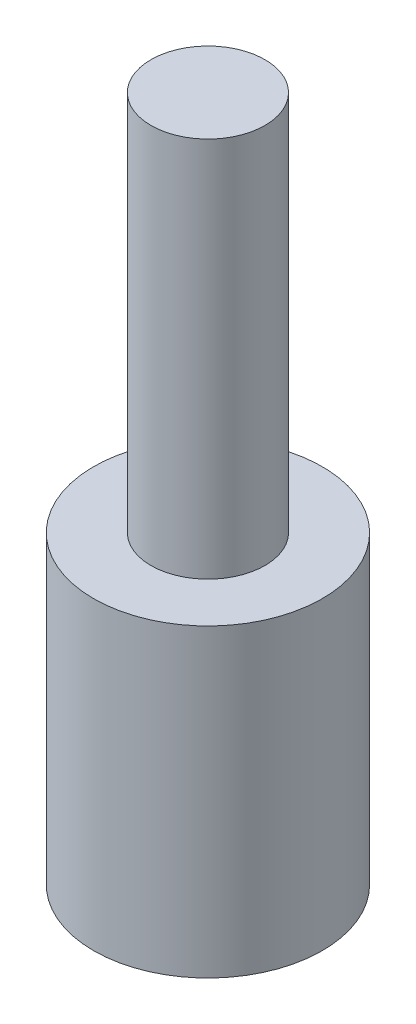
ISO-10303-21;
HEADER;
FILE_DESCRIPTION(('STEP AP214'),'2;1');
FILE_NAME('part.step','',(''),(''),'','','');
FILE_SCHEMA(('AUTOMOTIVE_DESIGN { 1 0 10303 214 1 1 1 1 }'));
ENDSEC;
DATA;
#1=APPLICATION_CONTEXT('core data for automotive mechanical design processes');
#2=APPLICATION_PROTOCOL_DEFINITION('international standard','automotive_design',2000,#1);
#3=PRODUCT_CONTEXT('',#1,'mechanical');
#4=PRODUCT('Part','Part','',(#3));
#5=PRODUCT_RELATED_PRODUCT_CATEGORY('part','',(#4));
#6=PRODUCT_DEFINITION_FORMATION('','',#4);
#7=PRODUCT_DEFINITION_CONTEXT('part definition',#1,'design');
#8=PRODUCT_DEFINITION('design','',#6,#7);
#9=PRODUCT_DEFINITION_SHAPE('','',#8);
#10=(LENGTH_UNIT() NAMED_UNIT(*) SI_UNIT(.MILLI.,.METRE.));
#11=(NAMED_UNIT(*) PLANE_ANGLE_UNIT() SI_UNIT($,.RADIAN.));
#12=(NAMED_UNIT(*) SI_UNIT($,.STERADIAN.) SOLID_ANGLE_UNIT());
#13=UNCERTAINTY_MEASURE_WITH_UNIT(LENGTH_MEASURE(1.E-05),#10,'distance_accuracy_value','');
#14=(GEOMETRIC_REPRESENTATION_CONTEXT(3) GLOBAL_UNCERTAINTY_ASSIGNED_CONTEXT((#13)) GLOBAL_UNIT_ASSIGNED_CONTEXT((#10,
#11,#12)) REPRESENTATION_CONTEXT('',''));
#15=CARTESIAN_POINT('',(0.,0.,0.));
#16=DIRECTION('',(0.,0.,1.));
#17=DIRECTION('',(1.,0.,0.));
#18=AXIS2_PLACEMENT_3D('',#15,#16,#17);
#19=CARTESIAN_POINT('',(0.,12.7,0.));
#20=DIRECTION('',(0.,1.,0.));
#21=DIRECTION('',(0.,0.,1.));
#22=AXIS2_PLACEMENT_3D('',#19,#20,#21);
#23=PLANE('',#22);
#24=CARTESIAN_POINT('',(0.,12.7,0.));
#25=DIRECTION('',(0.,1.,0.));
#26=DIRECTION('',(0.,0.,1.));
#27=AXIS2_PLACEMENT_3D('',#24,#25,#26);
#28=CIRCLE('',#27,4.7625);
#29=CARTESIAN_POINT('',(0.,12.7,4.7625));
#30=VERTEX_POINT('',#29);
#31=EDGE_CURVE('E10',#30,#30,#28,.T.);
#32=ORIENTED_EDGE('',*,*,#31,.T.);
#33=EDGE_LOOP('',(#32));
#34=FACE_BOUND('',#33,.T.);
#35=CARTESIAN_POINT('',(0.,12.7,0.));
#36=DIRECTION('',(0.,1.,0.));
#37=DIRECTION('',(0.,0.,1.));
#38=AXIS2_PLACEMENT_3D('',#35,#36,#37);
#39=CIRCLE('',#38,2.3749);
#40=CARTESIAN_POINT('',(0.,12.7,2.3749));
#41=VERTEX_POINT('',#40);
#42=EDGE_CURVE('E43',#41,#41,#39,.T.);
#43=ORIENTED_EDGE('',*,*,#42,.F.);
#44=EDGE_LOOP('',(#43));
#45=FACE_BOUND('',#44,.T.);
#46=ADVANCED_FACE('F30',(#34,#45),#23,.T.);
#47=CARTESIAN_POINT('',(0.,12.7,0.));
#48=DIRECTION('',(0.,-1.,0.));
#49=DIRECTION('',(0.,0.,-1.));
#50=AXIS2_PLACEMENT_3D('',#47,#48,#49);
#51=CYLINDRICAL_SURFACE('',#50,4.7625);
#52=ORIENTED_EDGE('',*,*,#31,.F.);
#53=EDGE_LOOP('',(#52));
#54=FACE_BOUND('',#53,.T.);
#55=CARTESIAN_POINT('',(0.,0.,0.));
#56=DIRECTION('',(0.,1.,0.));
#57=DIRECTION('',(0.,0.,1.));
#58=AXIS2_PLACEMENT_3D('',#55,#56,#57);
#59=CIRCLE('',#58,4.7625);
#60=CARTESIAN_POINT('',(0.,0.,4.7625));
#61=VERTEX_POINT('',#60);
#62=EDGE_CURVE('E34',#61,#61,#59,.T.);
#63=ORIENTED_EDGE('',*,*,#62,.T.);
#64=EDGE_LOOP('',(#63));
#65=FACE_BOUND('',#64,.T.);
#66=ADVANCED_FACE('F32',(#54,#65),#51,.T.);
#67=CARTESIAN_POINT('',(0.,0.,0.));
#68=DIRECTION('',(0.,1.,0.));
#69=DIRECTION('',(0.,0.,1.));
#70=AXIS2_PLACEMENT_3D('',#67,#68,#69);
#71=PLANE('',#70);
#72=CARTESIAN_POINT('',(0.,0.,0.));
#73=DIRECTION('',(0.,-1.,0.));
#74=DIRECTION('',(0.,0.,-1.));
#75=AXIS2_PLACEMENT_3D('',#72,#73,#74);
#76=CIRCLE('',#75,2.2225);
#77=CARTESIAN_POINT('',(0.,0.,-2.2225));
#78=VERTEX_POINT('',#77);
#79=EDGE_CURVE('E49',#78,#78,#76,.T.);
#80=ORIENTED_EDGE('',*,*,#79,.F.);
#81=EDGE_LOOP('',(#80));
#82=FACE_BOUND('',#81,.T.);
#83=ORIENTED_EDGE('',*,*,#62,.F.);
#84=EDGE_LOOP('',(#83));
#85=FACE_BOUND('',#84,.T.);
#86=ADVANCED_FACE('F64',(#82,#85),#71,.F.);
#87=CARTESIAN_POINT('',(0.,28.575,0.));
#88=DIRECTION('',(0.,-1.,0.));
#89=DIRECTION('',(0.,0.,-1.));
#90=AXIS2_PLACEMENT_3D('',#87,#88,#89);
#91=CYLINDRICAL_SURFACE('',#90,2.3749);
#92=CARTESIAN_POINT('',(0.,28.575,0.));
#93=DIRECTION('',(0.,1.,0.));
#94=DIRECTION('',(0.,0.,1.));
#95=AXIS2_PLACEMENT_3D('',#92,#93,#94);
#96=CIRCLE('',#95,2.3749);
#97=CARTESIAN_POINT('',(0.,28.575,2.3749));
#98=VERTEX_POINT('',#97);
#99=EDGE_CURVE('E41',#98,#98,#96,.T.);
#100=ORIENTED_EDGE('',*,*,#99,.F.);
#101=EDGE_LOOP('',(#100));
#102=FACE_BOUND('',#101,.T.);
#103=ORIENTED_EDGE('',*,*,#42,.T.);
#104=EDGE_LOOP('',(#103));
#105=FACE_BOUND('',#104,.T.);
#106=ADVANCED_FACE('F67',(#102,#105),#91,.T.);
#107=CARTESIAN_POINT('',(0.,28.575,0.));
#108=DIRECTION('',(0.,1.,0.));
#109=DIRECTION('',(0.,0.,1.));
#110=AXIS2_PLACEMENT_3D('',#107,#108,#109);
#111=PLANE('',#110);
#112=ORIENTED_EDGE('',*,*,#99,.T.);
#113=EDGE_LOOP('',(#112));
#114=FACE_BOUND('',#113,.T.);
#115=ADVANCED_FACE('F60',(#114),#111,.T.);
#116=CARTESIAN_POINT('',(0.,9.525,0.));
#117=DIRECTION('',(0.,-1.,0.));
#118=DIRECTION('',(0.,0.,-1.));
#119=AXIS2_PLACEMENT_3D('',#116,#117,#118);
#120=CYLINDRICAL_SURFACE('',#119,2.2225);
#121=CARTESIAN_POINT('',(0.,9.525,0.));
#122=DIRECTION('',(0.,-1.,0.));
#123=DIRECTION('',(0.,0.,-1.));
#124=AXIS2_PLACEMENT_3D('',#121,#122,#123);
#125=CIRCLE('',#124,2.2225);
#126=CARTESIAN_POINT('',(0.,9.525,-2.2225));
#127=VERTEX_POINT('',#126);
#128=EDGE_CURVE('E46',#127,#127,#125,.T.);
#129=CARTESIAN_POINT('',(0.,9.525,-2.2225));
#130=CARTESIAN_POINT('',(0.,9.42578125,-2.2225));
#131=CARTESIAN_POINT('',(0.,9.3265625,-2.2225));
#132=CARTESIAN_POINT('',(0.,9.128125,-2.2225));
#133=CARTESIAN_POINT('',(0.,9.02890625,-2.2225));
#134=CARTESIAN_POINT('',(0.,8.83046875,-2.2225));
#135=CARTESIAN_POINT('',(0.,8.73125,-2.2225));
#136=CARTESIAN_POINT('',(0.,8.5328125,-2.2225));
#137=CARTESIAN_POINT('',(0.,8.43359375,-2.2225));
#138=CARTESIAN_POINT('',(0.,8.23515625,-2.2225));
#139=CARTESIAN_POINT('',(0.,8.1359375,-2.2225));
#140=CARTESIAN_POINT('',(0.,7.9375,-2.2225));
#141=CARTESIAN_POINT('',(0.,7.83828125,-2.2225));
#142=CARTESIAN_POINT('',(0.,7.63984375,-2.2225));
#143=CARTESIAN_POINT('',(0.,7.540625,-2.2225));
#144=CARTESIAN_POINT('',(0.,7.3421875,-2.2225));
#145=CARTESIAN_POINT('',(0.,7.24296875,-2.2225));
#146=CARTESIAN_POINT('',(0.,7.04453125,-2.2225));
#147=CARTESIAN_POINT('',(0.,6.9453125,-2.2225));
#148=CARTESIAN_POINT('',(0.,6.746875,-2.2225));
#149=CARTESIAN_POINT('',(0.,6.64765625,-2.2225));
#150=CARTESIAN_POINT('',(0.,6.44921875,-2.2225));
#151=CARTESIAN_POINT('',(0.,6.35,-2.2225));
#152=CARTESIAN_POINT('',(0.,6.1515625,-2.2225));
#153=CARTESIAN_POINT('',(0.,6.05234375,-2.2225));
#154=CARTESIAN_POINT('',(0.,5.85390625,-2.2225));
#155=CARTESIAN_POINT('',(0.,5.7546875,-2.2225));
#156=CARTESIAN_POINT('',(0.,5.55625,-2.2225));
#157=CARTESIAN_POINT('',(0.,5.45703125,-2.2225));
#158=CARTESIAN_POINT('',(0.,5.25859375,-2.2225));
#159=CARTESIAN_POINT('',(0.,5.159375,-2.2225));
#160=CARTESIAN_POINT('',(0.,4.9609375,-2.2225));
#161=CARTESIAN_POINT('',(0.,4.86171875,-2.2225));
#162=CARTESIAN_POINT('',(0.,4.66328125,-2.2225));
#163=CARTESIAN_POINT('',(0.,4.5640625,-2.2225));
#164=CARTESIAN_POINT('',(0.,4.365625,-2.2225));
#165=CARTESIAN_POINT('',(0.,4.26640625,-2.2225));
#166=CARTESIAN_POINT('',(0.,4.06796875,-2.2225));
#167=CARTESIAN_POINT('',(0.,3.96875,-2.2225));
#168=CARTESIAN_POINT('',(0.,3.7703125,-2.2225));
#169=CARTESIAN_POINT('',(0.,3.67109375,-2.2225));
#170=CARTESIAN_POINT('',(0.,3.47265625,-2.2225));
#171=CARTESIAN_POINT('',(0.,3.3734375,-2.2225));
#172=CARTESIAN_POINT('',(0.,3.175,-2.2225));
#173=CARTESIAN_POINT('',(0.,3.07578125,-2.2225));
#174=CARTESIAN_POINT('',(0.,2.87734375,-2.2225));
#175=CARTESIAN_POINT('',(0.,2.778125,-2.2225));
#176=CARTESIAN_POINT('',(0.,2.5796875,-2.2225));
#177=CARTESIAN_POINT('',(0.,2.48046875,-2.2225));
#178=CARTESIAN_POINT('',(0.,2.28203125,-2.2225));
#179=CARTESIAN_POINT('',(0.,2.1828125,-2.2225));
#180=CARTESIAN_POINT('',(0.,1.984375,-2.2225));
#181=CARTESIAN_POINT('',(0.,1.88515625,-2.2225));
#182=CARTESIAN_POINT('',(0.,1.68671875,-2.2225));
#183=CARTESIAN_POINT('',(0.,1.5875,-2.2225));
#184=CARTESIAN_POINT('',(0.,1.3890625,-2.2225));
#185=CARTESIAN_POINT('',(0.,1.28984375,-2.2225));
#186=CARTESIAN_POINT('',(0.,1.09140625,-2.2225));
#187=CARTESIAN_POINT('',(0.,0.992187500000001,-2.2225));
#188=CARTESIAN_POINT('',(0.,0.793750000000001,-2.2225));
#189=CARTESIAN_POINT('',(0.,0.69453125,-2.2225));
#190=CARTESIAN_POINT('',(0.,0.49609375,-2.2225));
#191=CARTESIAN_POINT('',(0.,0.396875,-2.2225));
#192=CARTESIAN_POINT('',(0.,0.1984375,-2.2225));
#193=CARTESIAN_POINT('',(0.,0.0992187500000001,-2.2225));
#194=CARTESIAN_POINT('',(0.,0.,-2.2225));
#195=B_SPLINE_CURVE_WITH_KNOTS('',3,(#129,#130,#131,#132,#133,#134,#135,#136,#137,#138,#139,
#140,#141,#142,#143,#144,#145,#146,#147,#148,#149,#150,#151,#152,#153,#154,#155,#156,#157,#158,
#159,#160,#161,#162,#163,#164,#165,#166,#167,#168,#169,#170,#171,#172,#173,#174,#175,#176,#177,
#178,#179,#180,#181,#182,#183,#184,#185,#186,#187,#188,#189,#190,#191,#192,#193,#194),
.UNSPECIFIED.,.F.,.F.,(4,2,2,2,2,2,2,2,2,2,2,2,2,2,2,2,2,2,2,2,2,2,2,2,2,2,2,2,2,2,2,2,4),(0.,
0.29765625,0.5953125,0.892968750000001,1.190625,1.48828125,1.7859375,2.08359375,2.38125,
2.67890625,2.9765625,3.27421875,3.571875,3.86953125,4.1671875,4.46484375,4.7625,5.06015625,
5.3578125,5.65546875,5.953125,6.25078125,6.5484375,6.84609375,7.14375,7.44140625,7.7390625,
8.03671875,8.334375,8.63203125,8.9296875,9.22734375,9.525),.UNSPECIFIED.);
#196=EDGE_CURVE('BSEAM57',#127,#78,#195,.T.);
#197=ORIENTED_EDGE('',*,*,#128,.F.);
#198=ORIENTED_EDGE('',*,*,#79,.T.);
#199=ORIENTED_EDGE('',*,*,#196,.T.);
#200=ORIENTED_EDGE('',*,*,#196,.F.);
#201=EDGE_LOOP('',(#197,#199,#198,#200));
#202=FACE_BOUND('',#201,.T.);
#203=ADVANCED_FACE('F57',(#202),#120,.F.);
#204=CARTESIAN_POINT('',(0.,9.525,0.));
#205=DIRECTION('',(0.,-1.,0.));
#206=DIRECTION('',(0.,0.,-1.));
#207=AXIS2_PLACEMENT_3D('',#204,#205,#206);
#208=PLANE('',#207);
#209=ORIENTED_EDGE('',*,*,#128,.T.);
#210=EDGE_LOOP('',(#209));
#211=FACE_BOUND('',#210,.T.);
#212=ADVANCED_FACE('F55',(#211),#208,.T.);
#213=CLOSED_SHELL('',(#46,#66,#86,#106,#115,#203,#212));
#214=MANIFOLD_SOLID_BREP('B2',#213);
#215=ADVANCED_BREP_SHAPE_REPRESENTATION('',(#18,#214),#14);
#216=SHAPE_DEFINITION_REPRESENTATION(#9,#215);
ENDSEC;
END-ISO-10303-21;
